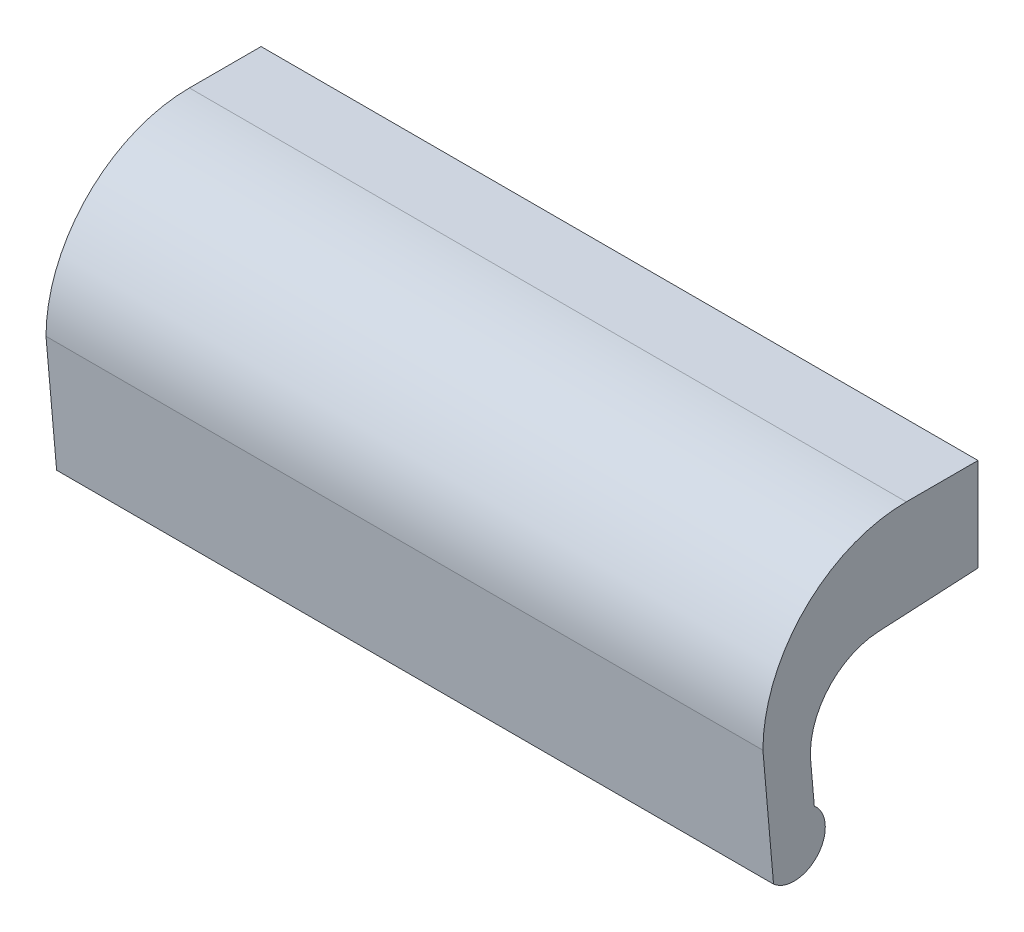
ISO-10303-21;
HEADER;
FILE_DESCRIPTION(('STEP AP214'),'2;1');
FILE_NAME('part.step','',(''),(''),'','','');
FILE_SCHEMA(('AUTOMOTIVE_DESIGN { 1 0 10303 214 1 1 1 1 }'));
ENDSEC;
DATA;
#1=APPLICATION_CONTEXT('core data for automotive mechanical design processes');
#2=APPLICATION_PROTOCOL_DEFINITION('international standard','automotive_design',2000,#1);
#3=PRODUCT_CONTEXT('',#1,'mechanical');
#4=PRODUCT('Part','Part','',(#3));
#5=PRODUCT_RELATED_PRODUCT_CATEGORY('part','',(#4));
#6=PRODUCT_DEFINITION_FORMATION('','',#4);
#7=PRODUCT_DEFINITION_CONTEXT('part definition',#1,'design');
#8=PRODUCT_DEFINITION('design','',#6,#7);
#9=PRODUCT_DEFINITION_SHAPE('','',#8);
#10=(LENGTH_UNIT() NAMED_UNIT(*) SI_UNIT(.MILLI.,.METRE.));
#11=(NAMED_UNIT(*) PLANE_ANGLE_UNIT() SI_UNIT($,.RADIAN.));
#12=(NAMED_UNIT(*) SI_UNIT($,.STERADIAN.) SOLID_ANGLE_UNIT());
#13=UNCERTAINTY_MEASURE_WITH_UNIT(LENGTH_MEASURE(1.E-05),#10,'distance_accuracy_value','');
#14=(GEOMETRIC_REPRESENTATION_CONTEXT(3) GLOBAL_UNCERTAINTY_ASSIGNED_CONTEXT((#13)) GLOBAL_UNIT_ASSIGNED_CONTEXT((#10,
#11,#12)) REPRESENTATION_CONTEXT('',''));
#15=CARTESIAN_POINT('',(0.,0.,0.));
#16=DIRECTION('',(0.,0.,1.));
#17=DIRECTION('',(1.,0.,0.));
#18=AXIS2_PLACEMENT_3D('',#15,#16,#17);
#19=CARTESIAN_POINT('',(-10.,6.5,0.));
#20=DIRECTION('',(0.,0.,1.));
#21=DIRECTION('',(-1.,0.,0.));
#22=AXIS2_PLACEMENT_3D('',#19,#20,#21);
#23=PLANE('',#22);
#24=CARTESIAN_POINT('',(0.,0.,0.));
#25=DIRECTION('',(0.,0.,-1.));
#26=DIRECTION('',(1.,0.,0.));
#27=AXIS2_PLACEMENT_3D('',#24,#25,#26);
#28=CIRCLE('',#27,3.);
#29=CARTESIAN_POINT('',(3.,0.,0.));
#30=VERTEX_POINT('',#29);
#31=EDGE_CURVE('E160',#30,#30,#28,.T.);
#32=ORIENTED_EDGE('',*,*,#31,.F.);
#33=EDGE_LOOP('',(#32));
#34=FACE_BOUND('',#33,.T.);
#35=DIRECTION('',(0.,-1.,0.));
#36=VECTOR('',#35,1.);
#37=CARTESIAN_POINT('',(90.,6.5,0.));
#38=LINE('',#37,#36);
#39=CARTESIAN_POINT('',(90.,6.5,0.));
#40=VERTEX_POINT('',#39);
#41=CARTESIAN_POINT('',(90.,-6.5,0.));
#42=VERTEX_POINT('',#41);
#43=EDGE_CURVE('E118',#40,#42,#38,.T.);
#44=ORIENTED_EDGE('',*,*,#43,.T.);
#45=DIRECTION('',(1.,0.,0.));
#46=VECTOR('',#45,1.);
#47=CARTESIAN_POINT('',(-10.,-6.5,0.));
#48=LINE('',#47,#46);
#49=CARTESIAN_POINT('',(-10.,-6.5,0.));
#50=VERTEX_POINT('',#49);
#51=EDGE_CURVE('E23',#50,#42,#48,.T.);
#52=ORIENTED_EDGE('',*,*,#51,.F.);
#53=DIRECTION('',(0.,-1.,0.));
#54=VECTOR('',#53,1.);
#55=CARTESIAN_POINT('',(-10.,6.5,0.));
#56=LINE('',#55,#54);
#57=CARTESIAN_POINT('',(-10.,6.5,0.));
#58=VERTEX_POINT('',#57);
#59=EDGE_CURVE('E75',#58,#50,#56,.T.);
#60=ORIENTED_EDGE('',*,*,#59,.F.);
#61=DIRECTION('',(1.,0.,0.));
#62=VECTOR('',#61,1.);
#63=CARTESIAN_POINT('',(-10.,6.5,0.));
#64=LINE('',#63,#62);
#65=EDGE_CURVE('E9',#58,#40,#64,.T.);
#66=ORIENTED_EDGE('',*,*,#65,.T.);
#67=EDGE_LOOP('',(#44,#52,#60,#66));
#68=FACE_BOUND('',#67,.T.);
#69=CARTESIAN_POINT('',(80.,0.,0.));
#70=DIRECTION('',(0.,0.,-1.));
#71=DIRECTION('',(1.,0.,0.));
#72=AXIS2_PLACEMENT_3D('',#69,#70,#71);
#73=CIRCLE('',#72,3.);
#74=CARTESIAN_POINT('',(83.,0.,0.));
#75=VERTEX_POINT('',#74);
#76=EDGE_CURVE('E166',#75,#75,#73,.T.);
#77=ORIENTED_EDGE('',*,*,#76,.F.);
#78=EDGE_LOOP('',(#77));
#79=FACE_BOUND('',#78,.T.);
#80=ADVANCED_FACE('F14',(#34,#68,#79),#23,.F.);
#81=CARTESIAN_POINT('',(-10.,6.5,10.));
#82=DIRECTION('',(0.,-1.,0.));
#83=DIRECTION('',(1.,0.,0.));
#84=AXIS2_PLACEMENT_3D('',#81,#82,#83);
#85=PLANE('',#84);
#86=DIRECTION('',(0.,0.,-1.));
#87=VECTOR('',#86,1.);
#88=CARTESIAN_POINT('',(90.,6.5,10.));
#89=LINE('',#88,#87);
#90=CARTESIAN_POINT('',(90.,6.5,10.));
#91=VERTEX_POINT('',#90);
#92=EDGE_CURVE('E115',#91,#40,#89,.T.);
#93=ORIENTED_EDGE('',*,*,#92,.T.);
#94=ORIENTED_EDGE('',*,*,#65,.F.);
#95=DIRECTION('',(0.,0.,-1.));
#96=VECTOR('',#95,1.);
#97=CARTESIAN_POINT('',(-10.,6.5,10.));
#98=LINE('',#97,#96);
#99=CARTESIAN_POINT('',(-10.,6.5,10.));
#100=VERTEX_POINT('',#99);
#101=EDGE_CURVE('E132',#100,#58,#98,.T.);
#102=ORIENTED_EDGE('',*,*,#101,.F.);
#103=DIRECTION('',(1.,0.,0.));
#104=VECTOR('',#103,1.);
#105=CARTESIAN_POINT('',(-10.,6.5,10.));
#106=LINE('',#105,#104);
#107=EDGE_CURVE('E111',#100,#91,#106,.T.);
#108=ORIENTED_EDGE('',*,*,#107,.T.);
#109=EDGE_LOOP('',(#93,#94,#102,#108));
#110=FACE_BOUND('',#109,.T.);
#111=ADVANCED_FACE('F16',(#110),#85,.F.);
#112=CARTESIAN_POINT('',(-10.,-6.5,0.));
#113=DIRECTION('',(0.,0.998629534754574,0.0523359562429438));
#114=DIRECTION('',(0.,0.0523359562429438,-0.998629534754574));
#115=AXIS2_PLACEMENT_3D('',#112,#113,#114);
#116=PLANE('',#115);
#117=DIRECTION('',(0.,-0.0523359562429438,0.998629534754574));
#118=VECTOR('',#117,1.);
#119=CARTESIAN_POINT('',(90.,-6.5,0.));
#120=LINE('',#119,#118);
#121=CARTESIAN_POINT('',(90.,-7.22831960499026,13.8971659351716));
#122=VERTEX_POINT('',#121);
#123=EDGE_CURVE('E121',#42,#122,#120,.T.);
#124=ORIENTED_EDGE('',*,*,#123,.T.);
#125=DIRECTION('',(1.,0.,0.));
#126=VECTOR('',#125,1.);
#127=CARTESIAN_POINT('',(-10.,-7.22831960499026,13.8971659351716));
#128=LINE('',#127,#126);
#129=CARTESIAN_POINT('',(-10.,-7.22831960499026,13.8971659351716));
#130=VERTEX_POINT('',#129);
#131=EDGE_CURVE('E138',#130,#122,#128,.T.);
#132=ORIENTED_EDGE('',*,*,#131,.F.);
#133=DIRECTION('',(0.,-0.0523359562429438,0.998629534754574));
#134=VECTOR('',#133,1.);
#135=CARTESIAN_POINT('',(-10.,-6.5,0.));
#136=LINE('',#135,#134);
#137=EDGE_CURVE('E145',#50,#130,#136,.T.);
#138=ORIENTED_EDGE('',*,*,#137,.F.);
#139=ORIENTED_EDGE('',*,*,#51,.T.);
#140=EDGE_LOOP('',(#124,#132,#138,#139));
#141=FACE_BOUND('',#140,.T.);
#142=ADVANCED_FACE('F143',(#141),#116,.F.);
#143=CARTESIAN_POINT('',(-10.,-17.214614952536,13.3738063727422));
#144=DIRECTION('',(1.,0.,0.));
#145=DIRECTION('',(0.,1.,0.));
#146=AXIS2_PLACEMENT_3D('',#143,#144,#145);
#147=CYLINDRICAL_SURFACE('',#146,10.);
#148=CARTESIAN_POINT('',(90.,-17.214614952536,13.3738063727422));
#149=DIRECTION('',(-1.,0.,0.));
#150=DIRECTION('',(0.,-1.,0.));
#151=AXIS2_PLACEMENT_3D('',#148,#149,#150);
#152=CIRCLE('',#151,10.);
#153=CARTESIAN_POINT('',(90.,-18.0861723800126,23.3357533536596));
#154=VERTEX_POINT('',#153);
#155=EDGE_CURVE('E124',#154,#122,#152,.T.);
#156=ORIENTED_EDGE('',*,*,#155,.F.);
#157=DIRECTION('',(1.,0.,0.));
#158=VECTOR('',#157,1.);
#159=CARTESIAN_POINT('',(-10.,-18.0861723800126,23.3357533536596));
#160=LINE('',#159,#158);
#161=CARTESIAN_POINT('',(-10.,-18.0861723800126,23.3357533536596));
#162=VERTEX_POINT('',#161);
#163=EDGE_CURVE('E136',#162,#154,#160,.T.);
#164=ORIENTED_EDGE('',*,*,#163,.F.);
#165=CARTESIAN_POINT('',(-10.,-17.214614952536,13.3738063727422));
#166=DIRECTION('',(-1.,0.,0.));
#167=DIRECTION('',(0.,-1.,0.));
#168=AXIS2_PLACEMENT_3D('',#165,#166,#167);
#169=CIRCLE('',#168,10.);
#170=EDGE_CURVE('E154',#162,#130,#169,.T.);
#171=ORIENTED_EDGE('',*,*,#170,.T.);
#172=ORIENTED_EDGE('',*,*,#131,.T.);
#173=EDGE_LOOP('',(#156,#164,#171,#172));
#174=FACE_BOUND('',#173,.T.);
#175=ADVANCED_FACE('F152',(#174),#147,.F.);
#176=CARTESIAN_POINT('',(-10.,-18.0861723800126,23.3357533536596));
#177=DIRECTION('',(0.,-0.0871557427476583,0.996194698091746));
#178=DIRECTION('',(0.,0.996194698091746,0.0871557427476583));
#179=AXIS2_PLACEMENT_3D('',#176,#177,#178);
#180=PLANE('',#179);
#181=DIRECTION('',(0.,-0.996194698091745,-0.0871557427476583));
#182=VECTOR('',#181,1.);
#183=CARTESIAN_POINT('',(90.,-18.0861723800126,23.3357533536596));
#184=LINE('',#183,#182);
#185=CARTESIAN_POINT('',(90.,-23.8355479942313,22.8327481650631));
#186=VERTEX_POINT('',#185);
#187=EDGE_CURVE('E127',#154,#186,#184,.T.);
#188=ORIENTED_EDGE('',*,*,#187,.T.);
#189=DIRECTION('',(1.,0.,0.));
#190=VECTOR('',#189,1.);
#191=CARTESIAN_POINT('',(-10.,-23.8355479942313,22.8327481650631));
#192=LINE('',#191,#190);
#193=CARTESIAN_POINT('',(-10.,-23.8355479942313,22.8327481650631));
#194=VERTEX_POINT('',#193);
#195=EDGE_CURVE('E106',#194,#186,#192,.T.);
#196=ORIENTED_EDGE('',*,*,#195,.F.);
#197=DIRECTION('',(0.,-0.996194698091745,-0.0871557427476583));
#198=VECTOR('',#197,1.);
#199=CARTESIAN_POINT('',(-10.,-18.0861723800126,23.3357533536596));
#200=LINE('',#199,#198);
#201=EDGE_CURVE('E97',#162,#194,#200,.T.);
#202=ORIENTED_EDGE('',*,*,#201,.F.);
#203=ORIENTED_EDGE('',*,*,#163,.T.);
#204=EDGE_LOOP('',(#188,#196,#202,#203));
#205=FACE_BOUND('',#204,.T.);
#206=ADVANCED_FACE('F195',(#205),#180,.F.);
#207=CARTESIAN_POINT('',(-10.,-27.15,25.65));
#208=DIRECTION('',(1.,0.,0.));
#209=DIRECTION('',(0.,1.,0.));
#210=AXIS2_PLACEMENT_3D('',#207,#208,#209);
#211=CYLINDRICAL_SURFACE('',#210,4.35);
#212=CARTESIAN_POINT('',(90.,-27.15,25.65));
#213=DIRECTION('',(-1.,0.,0.));
#214=DIRECTION('',(0.,-1.,0.));
#215=AXIS2_PLACEMENT_3D('',#212,#213,#214);
#216=CIRCLE('',#215,4.35);
#217=CARTESIAN_POINT('',(90.,-30.4190837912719,28.5197719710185));
#218=VERTEX_POINT('',#217);
#219=EDGE_CURVE('E105',#186,#218,#216,.T.);
#220=ORIENTED_EDGE('',*,*,#219,.T.);
#221=DIRECTION('',(1.,0.,0.));
#222=VECTOR('',#221,1.);
#223=CARTESIAN_POINT('',(-10.,-30.4190837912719,28.5197719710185));
#224=LINE('',#223,#222);
#225=CARTESIAN_POINT('',(-10.,-30.4190837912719,28.5197719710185));
#226=VERTEX_POINT('',#225);
#227=EDGE_CURVE('E102',#226,#218,#224,.T.);
#228=ORIENTED_EDGE('',*,*,#227,.F.);
#229=CARTESIAN_POINT('',(-10.,-27.15,25.65));
#230=DIRECTION('',(-1.,0.,0.));
#231=DIRECTION('',(0.,-1.,0.));
#232=AXIS2_PLACEMENT_3D('',#229,#230,#231);
#233=CIRCLE('',#232,4.35);
#234=EDGE_CURVE('E90',#194,#226,#233,.T.);
#235=ORIENTED_EDGE('',*,*,#234,.F.);
#236=ORIENTED_EDGE('',*,*,#195,.T.);
#237=EDGE_LOOP('',(#220,#228,#235,#236));
#238=FACE_BOUND('',#237,.T.);
#239=ADVANCED_FACE('F103',(#238),#211,.T.);
#240=CARTESIAN_POINT('',(-10.,-30.4190837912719,28.5197719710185));
#241=DIRECTION('',(0.,0.087155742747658,-0.996194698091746));
#242=DIRECTION('',(0.,-0.996194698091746,-0.087155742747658));
#243=AXIS2_PLACEMENT_3D('',#240,#241,#242);
#244=PLANE('',#243);
#245=DIRECTION('',(0.,0.996194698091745,0.087155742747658));
#246=VECTOR('',#245,1.);
#247=CARTESIAN_POINT('',(90.,-30.4190837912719,28.5197719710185));
#248=LINE('',#247,#246);
#249=CARTESIAN_POINT('',(90.,-13.5,30.));
#250=VERTEX_POINT('',#249);
#251=EDGE_CURVE('E61',#218,#250,#248,.T.);
#252=ORIENTED_EDGE('',*,*,#251,.T.);
#253=DIRECTION('',(1.,0.,0.));
#254=VECTOR('',#253,1.);
#255=CARTESIAN_POINT('',(-10.,-13.5,30.));
#256=LINE('',#255,#254);
#257=CARTESIAN_POINT('',(-10.,-13.5,30.));
#258=VERTEX_POINT('',#257);
#259=EDGE_CURVE('E107',#258,#250,#256,.T.);
#260=ORIENTED_EDGE('',*,*,#259,.F.);
#261=DIRECTION('',(0.,0.996194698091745,0.087155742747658));
#262=VECTOR('',#261,1.);
#263=CARTESIAN_POINT('',(-10.,-30.4190837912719,28.5197719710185));
#264=LINE('',#263,#262);
#265=EDGE_CURVE('E94',#226,#258,#264,.T.);
#266=ORIENTED_EDGE('',*,*,#265,.F.);
#267=ORIENTED_EDGE('',*,*,#227,.T.);
#268=EDGE_LOOP('',(#252,#260,#266,#267));
#269=FACE_BOUND('',#268,.T.);
#270=ADVANCED_FACE('F109',(#269),#244,.F.);
#271=CARTESIAN_POINT('',(-10.,-13.5,10.));
#272=DIRECTION('',(1.,0.,0.));
#273=DIRECTION('',(0.,1.,0.));
#274=AXIS2_PLACEMENT_3D('',#271,#272,#273);
#275=CYLINDRICAL_SURFACE('',#274,20.);
#276=CARTESIAN_POINT('',(90.,-13.5,10.));
#277=DIRECTION('',(-1.,0.,0.));
#278=DIRECTION('',(0.,-1.,0.));
#279=AXIS2_PLACEMENT_3D('',#276,#277,#278);
#280=CIRCLE('',#279,20.);
#281=EDGE_CURVE('E67',#250,#91,#280,.T.);
#282=ORIENTED_EDGE('',*,*,#281,.T.);
#283=ORIENTED_EDGE('',*,*,#107,.F.);
#284=CARTESIAN_POINT('',(-10.,-13.5,10.));
#285=DIRECTION('',(-1.,0.,0.));
#286=DIRECTION('',(0.,-1.,0.));
#287=AXIS2_PLACEMENT_3D('',#284,#285,#286);
#288=CIRCLE('',#287,20.);
#289=EDGE_CURVE('E31',#258,#100,#288,.T.);
#290=ORIENTED_EDGE('',*,*,#289,.F.);
#291=ORIENTED_EDGE('',*,*,#259,.T.);
#292=EDGE_LOOP('',(#282,#283,#290,#291));
#293=FACE_BOUND('',#292,.T.);
#294=ADVANCED_FACE('F203',(#293),#275,.T.);
#295=CARTESIAN_POINT('',(-10.,-17.214614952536,13.3738063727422));
#296=DIRECTION('',(-1.,0.,0.));
#297=DIRECTION('',(0.,-1.,0.));
#298=AXIS2_PLACEMENT_3D('',#295,#296,#297);
#299=PLANE('',#298);
#300=ORIENTED_EDGE('',*,*,#101,.T.);
#301=ORIENTED_EDGE('',*,*,#59,.T.);
#302=ORIENTED_EDGE('',*,*,#137,.T.);
#303=ORIENTED_EDGE('',*,*,#170,.F.);
#304=ORIENTED_EDGE('',*,*,#201,.T.);
#305=ORIENTED_EDGE('',*,*,#234,.T.);
#306=ORIENTED_EDGE('',*,*,#265,.T.);
#307=ORIENTED_EDGE('',*,*,#289,.T.);
#308=EDGE_LOOP('',(#300,#301,#302,#303,#304,#305,#306,#307));
#309=FACE_BOUND('',#308,.T.);
#310=ADVANCED_FACE('F92',(#309),#299,.T.);
#311=CARTESIAN_POINT('',(90.,-17.214614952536,13.3738063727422));
#312=DIRECTION('',(-1.,0.,0.));
#313=DIRECTION('',(0.,-1.,0.));
#314=AXIS2_PLACEMENT_3D('',#311,#312,#313);
#315=PLANE('',#314);
#316=ORIENTED_EDGE('',*,*,#92,.F.);
#317=ORIENTED_EDGE('',*,*,#281,.F.);
#318=ORIENTED_EDGE('',*,*,#251,.F.);
#319=ORIENTED_EDGE('',*,*,#219,.F.);
#320=ORIENTED_EDGE('',*,*,#187,.F.);
#321=ORIENTED_EDGE('',*,*,#155,.T.);
#322=ORIENTED_EDGE('',*,*,#123,.F.);
#323=ORIENTED_EDGE('',*,*,#43,.F.);
#324=EDGE_LOOP('',(#316,#317,#318,#319,#320,#321,#322,#323));
#325=FACE_BOUND('',#324,.T.);
#326=ADVANCED_FACE('F148',(#325),#315,.F.);
#327=CARTESIAN_POINT('',(0.,0.,10.));
#328=DIRECTION('',(0.,0.,-1.));
#329=DIRECTION('',(1.,0.,0.));
#330=AXIS2_PLACEMENT_3D('',#327,#328,#329);
#331=CYLINDRICAL_SURFACE('',#330,3.);
#332=CARTESIAN_POINT('',(0.,0.,10.));
#333=DIRECTION('',(0.,0.,-1.));
#334=DIRECTION('',(1.,0.,0.));
#335=AXIS2_PLACEMENT_3D('',#332,#333,#334);
#336=CIRCLE('',#335,3.);
#337=CARTESIAN_POINT('',(3.,0.,10.));
#338=VERTEX_POINT('',#337);
#339=EDGE_CURVE('E119',#338,#338,#336,.T.);
#340=ORIENTED_EDGE('',*,*,#339,.F.);
#341=EDGE_LOOP('',(#340));
#342=FACE_BOUND('',#341,.T.);
#343=ORIENTED_EDGE('',*,*,#31,.T.);
#344=EDGE_LOOP('',(#343));
#345=FACE_BOUND('',#344,.T.);
#346=ADVANCED_FACE('F208',(#342,#345),#331,.F.);
#347=CARTESIAN_POINT('',(0.,0.,10.));
#348=DIRECTION('',(0.,0.,-1.));
#349=DIRECTION('',(1.,0.,0.));
#350=AXIS2_PLACEMENT_3D('',#347,#348,#349);
#351=PLANE('',#350);
#352=CARTESIAN_POINT('',(0.,0.,10.));
#353=VERTEX_POINT('',#352);
#354=VERTEX_LOOP('',#353);
#355=FACE_BOUND('',#354,.T.);
#356=ORIENTED_EDGE('',*,*,#339,.T.);
#357=EDGE_LOOP('',(#356));
#358=FACE_BOUND('',#357,.T.);
#359=ADVANCED_FACE('F177',(#355,#358),#351,.T.);
#360=CARTESIAN_POINT('',(80.,0.,10.));
#361=DIRECTION('',(0.,0.,-1.));
#362=DIRECTION('',(1.,0.,0.));
#363=AXIS2_PLACEMENT_3D('',#360,#361,#362);
#364=CYLINDRICAL_SURFACE('',#363,3.);
#365=CARTESIAN_POINT('',(80.,0.,10.));
#366=DIRECTION('',(0.,0.,-1.));
#367=DIRECTION('',(1.,0.,0.));
#368=AXIS2_PLACEMENT_3D('',#365,#366,#367);
#369=CIRCLE('',#368,3.);
#370=CARTESIAN_POINT('',(83.,0.,10.));
#371=VERTEX_POINT('',#370);
#372=EDGE_CURVE('E163',#371,#371,#369,.T.);
#373=ORIENTED_EDGE('',*,*,#372,.F.);
#374=EDGE_LOOP('',(#373));
#375=FACE_BOUND('',#374,.T.);
#376=ORIENTED_EDGE('',*,*,#76,.T.);
#377=EDGE_LOOP('',(#376));
#378=FACE_BOUND('',#377,.T.);
#379=ADVANCED_FACE('F174',(#375,#378),#364,.F.);
#380=CARTESIAN_POINT('',(80.,0.,10.));
#381=DIRECTION('',(0.,0.,-1.));
#382=DIRECTION('',(1.,0.,0.));
#383=AXIS2_PLACEMENT_3D('',#380,#381,#382);
#384=PLANE('',#383);
#385=CARTESIAN_POINT('',(80.,0.,10.));
#386=VERTEX_POINT('',#385);
#387=VERTEX_LOOP('',#386);
#388=FACE_BOUND('',#387,.T.);
#389=ORIENTED_EDGE('',*,*,#372,.T.);
#390=EDGE_LOOP('',(#389));
#391=FACE_BOUND('',#390,.T.);
#392=ADVANCED_FACE('F172',(#388,#391),#384,.T.);
#393=CLOSED_SHELL('',(#80,#111,#142,#175,#206,#239,#270,#294,#310,#326,#346,#359,#379,#392));
#394=MANIFOLD_SOLID_BREP('B1',#393);
#395=ADVANCED_BREP_SHAPE_REPRESENTATION('',(#18,#394),#14);
#396=SHAPE_DEFINITION_REPRESENTATION(#9,#395);
ENDSEC;
END-ISO-10303-21;
